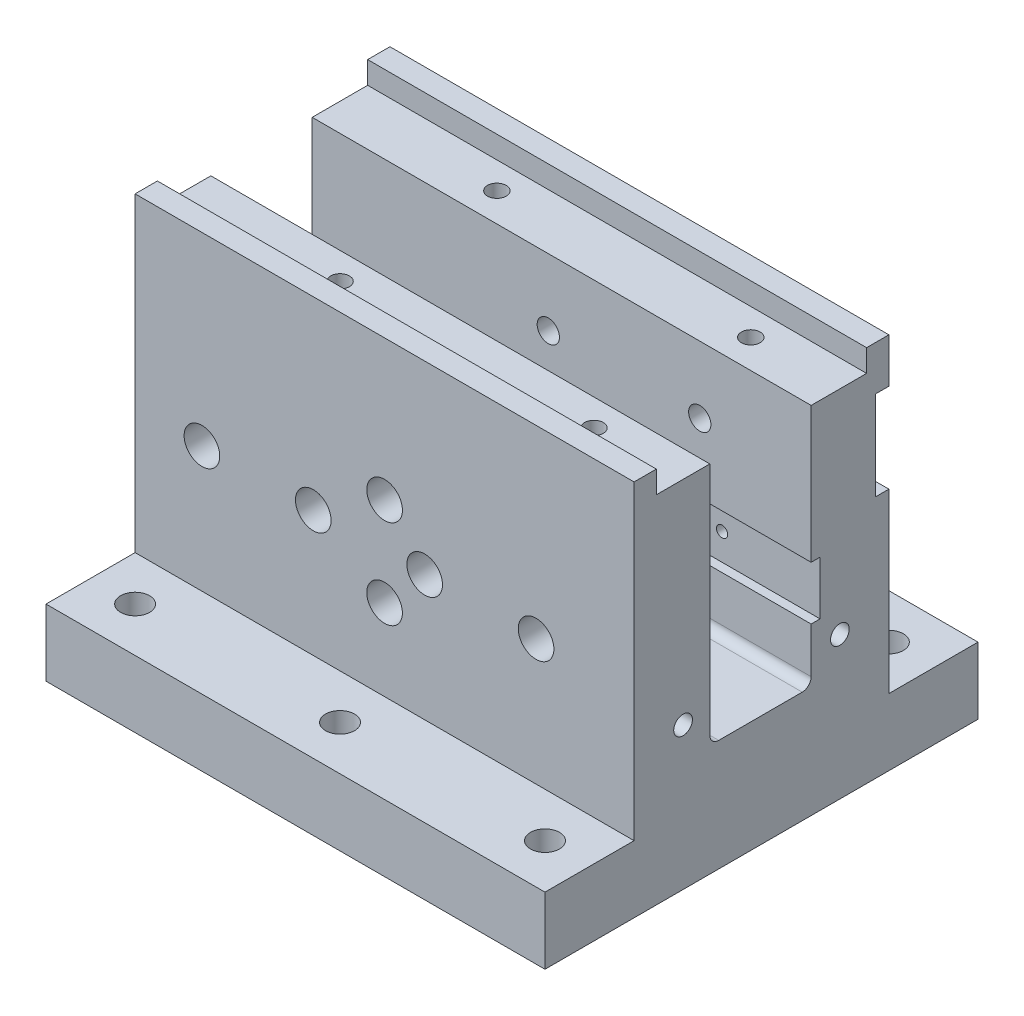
from build123d import *

# Parameters (mm, degrees)
SKETCH_1_W          = 112
SKETCH_1_H          = 84.74
EXTRUDE_1_DEPTH     = 97.2
SKETCH_3_OUTSIDE_W  = 133.36
SKETCH_3_OUTSIDE_H  = 120.9
CUT_EXTRUDE_1_DEPTH = 171.800197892
SKETCH_4_R          = 4
CUT_EXTRUDE_2_DEPTH = 20
SKETCH_5_R          = 1.25
CUT_EXTRUDE_3_DEPTH = 20
SKETCH_7_R          = 2.5
CUT_EXTRUDE_4_DEPTH = 20
SKETCH_8_R          = 3.25
CUT_EXTRUDE_5_DEPTH = 20
SKETCH_9_R          = 2.1
CUT_EXTRUDE_6_DEPTH = 20
SKETCH_10_R         = 2.1
CUT_EXTRUDE_7_DEPTH = 10


with BuildPart() as part:
    # Sketch 1 → Extrude 1 (new body)
    with BuildSketch(Plane.XY):
        with Locations((56, 42.37)):
            Rectangle(SKETCH_1_W, SKETCH_1_H)
    extrude(amount=EXTRUDE_1_DEPTH)

    # Sketch 3 outside → Cut-Extrude 1 (cut, through all)
    with BuildSketch(Plane(origin=(112, 0, 0), x_dir=(0, 0, -1), z_dir=(1, 0, 0))):
        with Locations((-48.6, 42.37)):
            Rectangle(SKETCH_3_OUTSIDE_W, SKETCH_3_OUTSIDE_H)
        with BuildLine():
            Line((-72.2, 79.74), (-72.2, 84.74))
            Line((-72.2, 84.74), (-77.2, 84.74))
            Line((-77.2, 84.74), (-77.2, 15))
            Line((-77.2, 15), (-97.2, 15))
            Line((-97.2, 15), (-97.2, 0))
            Line((-97.2, 0), (0, 0))
            Line((0, 0), (0, 15))
            Line((0, 15), (-20, 15))
            Line((-20, 15), (-20, 54.74))
            Line((-20, 54.74), (-23, 54.74))
            Line((-23, 54.74), (-23, 74.74))
            Line((-23, 74.74), (-20, 74.74))
            Line((-20, 74.74), (-20, 84.74))
            Line((-20, 84.74), (-25, 84.74))
            Line((-25, 84.74), (-25, 79.74))
            Line((-25, 79.74), (-37.45, 79.74))
            Line((-37.45, 79.74), (-37.45, 49.24))
            Line((-37.45, 49.24), (-35.45, 49.24))
            Line((-35.45, 49.24), (-35.45, 37.24))
            Line((-35.45, 37.24), (-37.45, 37.24))
            Line((-37.45, 37.24), (-37.45, 27))
            ThreePointArc((-37.45, 27), (-38.035786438, 25.585786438), (-39.45, 25))
            Line((-39.45, 25), (-58.2, 25))
            ThreePointArc((-58.2, 25), (-59.614213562, 25.585786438), (-60.2, 27))
            Line((-60.2, 27), (-60.2, 79.74))
            Line((-60.2, 79.74), (-72.2, 79.74))
        make_face(mode=Mode.SUBTRACT)
    extrude(amount=-CUT_EXTRUDE_1_DEPTH, mode=Mode.SUBTRACT)

    # Sketch 4 → Cut-Extrude 2 (cut)
    with BuildSketch(Plane.XY.offset(77.2)):
        with Locations((15, 43.24)):
            Circle(SKETCH_4_R)
        with Locations((40, 43.24)):
            Circle(SKETCH_4_R)
        with Locations((65, 43.24)):
            Circle(SKETCH_4_R)
        with Locations((90, 43.24)):
            Circle(SKETCH_4_R)
        with Locations((56, 53.24)):
            Circle(SKETCH_4_R)
        with Locations((56, 33.24)):
            Circle(SKETCH_4_R)
    extrude(amount=-CUT_EXTRUDE_2_DEPTH, mode=Mode.SUBTRACT)

    # Sketch 5 → Cut-Extrude 3 (cut)
    with BuildSketch(Plane.XY.offset(35.45)):
        with Locations((40, 43.24)):
            Circle(SKETCH_5_R)
        with Locations((15, 43.24)):
            Circle(SKETCH_5_R)
        with Locations((65, 43.24)):
            Circle(SKETCH_5_R)
        with Locations((90, 43.24)):
            Circle(SKETCH_5_R)
    extrude(amount=-CUT_EXTRUDE_3_DEPTH, mode=Mode.SUBTRACT)

    # Sketch 7 → Cut-Extrude 4 (cut)
    with BuildSketch(Plane(origin=(0, 0, 23), x_dir=(-1, 0, 0), z_dir=(0, 0, -1))):
        with Locations((-87, 64.74)):
            Circle(SKETCH_7_R)
        with Locations((-53, 64.74)):
            Circle(SKETCH_7_R)
    extrude(amount=-CUT_EXTRUDE_4_DEPTH, mode=Mode.SUBTRACT)

    # Sketch 8 → Cut-Extrude 5 (cut)
    with BuildSketch(Plane(origin=(0, 15, 0), x_dir=(1, 0, 0), z_dir=(0, 1, 0))):
        with Locations(Location((10, -10, 0), (0, 0, 270))):
            Circle(SKETCH_8_R)
        with Locations(Location((56, -10, 0), (0, 0, 270))):
            Circle(SKETCH_8_R)
        with Locations(Location((102, -10, 0), (0, 0, 270))):
            Circle(SKETCH_8_R)
        with Locations(Location((102, -87.2, 0), (0, 0, 270))):
            Circle(SKETCH_8_R)
        with Locations(Location((56, -87.2, 0), (0, 0, 270))):
            Circle(SKETCH_8_R)
        with Locations(Location((10, -87.2, 0), (0, 0, 270))):
            Circle(SKETCH_8_R)
    extrude(amount=-CUT_EXTRUDE_5_DEPTH, mode=Mode.SUBTRACT)

    # Sketch 9 → Cut-Extrude 6 (cut)
    with BuildSketch(Plane(origin=(0, 79.74, 0), x_dir=(1, 0, 0), z_dir=(0, 1, 0))):
        with Locations(Location((35, -31, 0), (0, 0, 270))):
            Circle(SKETCH_9_R)
        with Locations(Location((92, -31, 0), (0, 0, 270))):
            Circle(SKETCH_9_R)
        with Locations(Location((92, -66.2, 0), (0, 0, 270))):
            Circle(SKETCH_9_R)
        with Locations(Location((35, -66.2, 0), (0, 0, 270))):
            Circle(SKETCH_9_R)
    extrude(amount=-CUT_EXTRUDE_6_DEPTH, mode=Mode.SUBTRACT)

    # Sketch 10 → Cut-Extrude 7 (cut)
    with BuildSketch(Plane(origin=(112, 0, 0), x_dir=(0, 0, -1), z_dir=(1, 0, 0))):
        with Locations((-66.2, 32)):
            Circle(SKETCH_10_R)
        with Locations((-31, 32)):
            Circle(SKETCH_10_R)
    extrude(amount=-CUT_EXTRUDE_7_DEPTH, mode=Mode.SUBTRACT)


solid = part.part
